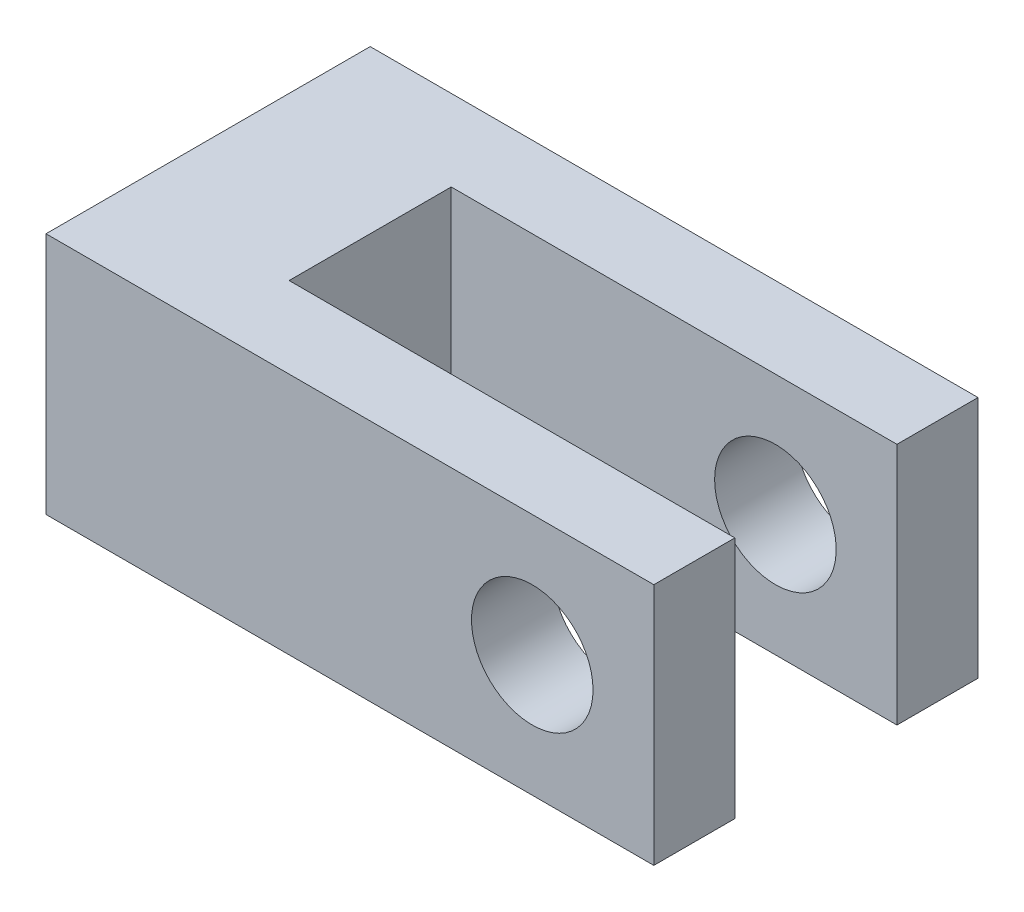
ISO-10303-21;
HEADER;
FILE_DESCRIPTION(('STEP AP214'),'2;1');
FILE_NAME('part.step','',(''),(''),'','','');
FILE_SCHEMA(('AUTOMOTIVE_DESIGN { 1 0 10303 214 1 1 1 1 }'));
ENDSEC;
DATA;
#1=APPLICATION_CONTEXT('core data for automotive mechanical design processes');
#2=APPLICATION_PROTOCOL_DEFINITION('international standard','automotive_design',2000,#1);
#3=PRODUCT_CONTEXT('',#1,'mechanical');
#4=PRODUCT('Part','Part','',(#3));
#5=PRODUCT_RELATED_PRODUCT_CATEGORY('part','',(#4));
#6=PRODUCT_DEFINITION_FORMATION('','',#4);
#7=PRODUCT_DEFINITION_CONTEXT('part definition',#1,'design');
#8=PRODUCT_DEFINITION('design','',#6,#7);
#9=PRODUCT_DEFINITION_SHAPE('','',#8);
#10=(LENGTH_UNIT() NAMED_UNIT(*) SI_UNIT(.MILLI.,.METRE.));
#11=(NAMED_UNIT(*) PLANE_ANGLE_UNIT() SI_UNIT($,.RADIAN.));
#12=(NAMED_UNIT(*) SI_UNIT($,.STERADIAN.) SOLID_ANGLE_UNIT());
#13=UNCERTAINTY_MEASURE_WITH_UNIT(LENGTH_MEASURE(1.E-05),#10,'distance_accuracy_value','');
#14=(GEOMETRIC_REPRESENTATION_CONTEXT(3) GLOBAL_UNCERTAINTY_ASSIGNED_CONTEXT((#13)) GLOBAL_UNIT_ASSIGNED_CONTEXT((#10,
#11,#12)) REPRESENTATION_CONTEXT('',''));
#15=CARTESIAN_POINT('',(0.,0.,0.));
#16=DIRECTION('',(0.,0.,1.));
#17=DIRECTION('',(1.,0.,0.));
#18=AXIS2_PLACEMENT_3D('',#15,#16,#17);
#19=CARTESIAN_POINT('',(9.525,9.525,25.4));
#20=DIRECTION('',(-1.,0.,0.));
#21=DIRECTION('',(0.,0.,1.));
#22=AXIS2_PLACEMENT_3D('',#19,#20,#21);
#23=PLANE('',#22);
#24=DIRECTION('',(0.,0.,-1.));
#25=VECTOR('',#24,1.);
#26=CARTESIAN_POINT('',(9.525,-9.525,25.4));
#27=LINE('',#26,#25);
#28=CARTESIAN_POINT('',(9.525,-9.525,25.4));
#29=VERTEX_POINT('',#28);
#30=CARTESIAN_POINT('',(9.525,-9.525,19.05));
#31=VERTEX_POINT('',#30);
#32=EDGE_CURVE('E45',#29,#31,#27,.T.);
#33=ORIENTED_EDGE('',*,*,#32,.T.);
#34=DIRECTION('',(0.,1.,0.));
#35=VECTOR('',#34,1.);
#36=CARTESIAN_POINT('',(9.525,-9.525,19.05));
#37=LINE('',#36,#35);
#38=CARTESIAN_POINT('',(9.525,9.525,19.05));
#39=VERTEX_POINT('',#38);
#40=EDGE_CURVE('E141',#31,#39,#37,.T.);
#41=ORIENTED_EDGE('',*,*,#40,.T.);
#42=DIRECTION('',(0.,0.,-1.));
#43=VECTOR('',#42,1.);
#44=CARTESIAN_POINT('',(9.525,9.525,25.4));
#45=LINE('',#44,#43);
#46=CARTESIAN_POINT('',(9.525,9.525,25.4));
#47=VERTEX_POINT('',#46);
#48=EDGE_CURVE('E131',#47,#39,#45,.T.);
#49=ORIENTED_EDGE('',*,*,#48,.F.);
#50=DIRECTION('',(0.,1.,0.));
#51=VECTOR('',#50,1.);
#52=CARTESIAN_POINT('',(9.525,9.525,25.4));
#53=LINE('',#52,#51);
#54=EDGE_CURVE('E158',#29,#47,#53,.T.);
#55=ORIENTED_EDGE('',*,*,#54,.F.);
#56=EDGE_LOOP('',(#33,#41,#49,#55));
#57=FACE_BOUND('',#56,.T.);
#58=ADVANCED_FACE('F36',(#57),#23,.F.);
#59=CARTESIAN_POINT('',(0.,0.,25.4));
#60=DIRECTION('',(0.,0.,-1.));
#61=DIRECTION('',(-1.,0.,0.));
#62=AXIS2_PLACEMENT_3D('',#59,#60,#61);
#63=CYLINDRICAL_SURFACE('',#62,4.7625);
#64=CARTESIAN_POINT('',(0.,0.,19.05));
#65=DIRECTION('',(0.,0.,1.));
#66=DIRECTION('',(1.,0.,0.));
#67=AXIS2_PLACEMENT_3D('',#64,#65,#66);
#68=CIRCLE('',#67,4.7625);
#69=CARTESIAN_POINT('',(4.7625,0.,19.05));
#70=VERTEX_POINT('',#69);
#71=EDGE_CURVE('E140',#70,#70,#68,.T.);
#72=ORIENTED_EDGE('',*,*,#71,.F.);
#73=EDGE_LOOP('',(#72));
#74=FACE_BOUND('',#73,.T.);
#75=CARTESIAN_POINT('',(0.,0.,25.4));
#76=DIRECTION('',(0.,0.,1.));
#77=DIRECTION('',(1.,0.,0.));
#78=AXIS2_PLACEMENT_3D('',#75,#76,#77);
#79=CIRCLE('',#78,4.7625);
#80=CARTESIAN_POINT('',(4.7625,0.,25.4));
#81=VERTEX_POINT('',#80);
#82=EDGE_CURVE('E147',#81,#81,#79,.T.);
#83=ORIENTED_EDGE('',*,*,#82,.T.);
#84=EDGE_LOOP('',(#83));
#85=FACE_BOUND('',#84,.T.);
#86=ADVANCED_FACE('F215',(#74,#85),#63,.F.);
#87=CARTESIAN_POINT('',(0.,0.,25.4));
#88=DIRECTION('',(0.,0.,1.));
#89=DIRECTION('',(1.,0.,0.));
#90=AXIS2_PLACEMENT_3D('',#87,#88,#89);
#91=PLANE('',#90);
#92=DIRECTION('',(0.,-1.,0.));
#93=VECTOR('',#92,1.);
#94=CARTESIAN_POINT('',(-38.1,9.525,25.4));
#95=LINE('',#94,#93);
#96=CARTESIAN_POINT('',(-38.1,9.525,25.4));
#97=VERTEX_POINT('',#96);
#98=CARTESIAN_POINT('',(-38.1,-9.525,25.4));
#99=VERTEX_POINT('',#98);
#100=EDGE_CURVE('E155',#97,#99,#95,.T.);
#101=ORIENTED_EDGE('',*,*,#100,.T.);
#102=DIRECTION('',(1.,0.,0.));
#103=VECTOR('',#102,1.);
#104=CARTESIAN_POINT('',(-38.1,-9.525,25.4));
#105=LINE('',#104,#103);
#106=EDGE_CURVE('E89',#99,#29,#105,.T.);
#107=ORIENTED_EDGE('',*,*,#106,.T.);
#108=ORIENTED_EDGE('',*,*,#54,.T.);
#109=DIRECTION('',(-1.,0.,0.));
#110=VECTOR('',#109,1.);
#111=CARTESIAN_POINT('',(-38.1,9.525,25.4));
#112=LINE('',#111,#110);
#113=EDGE_CURVE('E62',#47,#97,#112,.T.);
#114=ORIENTED_EDGE('',*,*,#113,.T.);
#115=EDGE_LOOP('',(#101,#107,#108,#114));
#116=FACE_BOUND('',#115,.T.);
#117=ORIENTED_EDGE('',*,*,#82,.F.);
#118=EDGE_LOOP('',(#117));
#119=FACE_BOUND('',#118,.T.);
#120=ADVANCED_FACE('F176',(#116,#119),#91,.T.);
#121=CARTESIAN_POINT('',(0.,0.,0.));
#122=DIRECTION('',(0.,0.,1.));
#123=DIRECTION('',(1.,0.,0.));
#124=AXIS2_PLACEMENT_3D('',#121,#122,#123);
#125=PLANE('',#124);
#126=DIRECTION('',(0.,-1.,0.));
#127=VECTOR('',#126,1.);
#128=CARTESIAN_POINT('',(-38.1,9.525,0.));
#129=LINE('',#128,#127);
#130=CARTESIAN_POINT('',(-38.1,9.525,0.));
#131=VERTEX_POINT('',#130);
#132=CARTESIAN_POINT('',(-38.1,-9.525,0.));
#133=VERTEX_POINT('',#132);
#134=EDGE_CURVE('E152',#131,#133,#129,.T.);
#135=ORIENTED_EDGE('',*,*,#134,.F.);
#136=DIRECTION('',(-1.,0.,0.));
#137=VECTOR('',#136,1.);
#138=CARTESIAN_POINT('',(-38.1,9.525,0.));
#139=LINE('',#138,#137);
#140=CARTESIAN_POINT('',(9.525,9.525,0.));
#141=VERTEX_POINT('',#140);
#142=EDGE_CURVE('E82',#141,#131,#139,.T.);
#143=ORIENTED_EDGE('',*,*,#142,.F.);
#144=DIRECTION('',(0.,1.,0.));
#145=VECTOR('',#144,1.);
#146=CARTESIAN_POINT('',(9.525,9.525,0.));
#147=LINE('',#146,#145);
#148=CARTESIAN_POINT('',(9.525,-9.525,0.));
#149=VERTEX_POINT('',#148);
#150=EDGE_CURVE('E165',#149,#141,#147,.T.);
#151=ORIENTED_EDGE('',*,*,#150,.F.);
#152=DIRECTION('',(1.,0.,0.));
#153=VECTOR('',#152,1.);
#154=CARTESIAN_POINT('',(-38.1,-9.525,0.));
#155=LINE('',#154,#153);
#156=EDGE_CURVE('E129',#133,#149,#155,.T.);
#157=ORIENTED_EDGE('',*,*,#156,.F.);
#158=EDGE_LOOP('',(#135,#143,#151,#157));
#159=FACE_BOUND('',#158,.T.);
#160=CARTESIAN_POINT('',(0.,0.,0.));
#161=DIRECTION('',(0.,0.,1.));
#162=DIRECTION('',(1.,0.,0.));
#163=AXIS2_PLACEMENT_3D('',#160,#161,#162);
#164=CIRCLE('',#163,4.7625);
#165=CARTESIAN_POINT('',(4.7625,0.,0.));
#166=VERTEX_POINT('',#165);
#167=EDGE_CURVE('E143',#166,#166,#164,.T.);
#168=ORIENTED_EDGE('',*,*,#167,.T.);
#169=EDGE_LOOP('',(#168));
#170=FACE_BOUND('',#169,.T.);
#171=ADVANCED_FACE('F174',(#159,#170),#125,.F.);
#172=CARTESIAN_POINT('',(-38.1,9.525,25.4));
#173=DIRECTION('',(1.,0.,0.));
#174=DIRECTION('',(0.,0.,-1.));
#175=AXIS2_PLACEMENT_3D('',#172,#173,#174);
#176=PLANE('',#175);
#177=CARTESIAN_POINT('',(-38.1,0.,12.7));
#178=DIRECTION('',(-1.,0.,0.));
#179=DIRECTION('',(0.,0.,1.));
#180=AXIS2_PLACEMENT_3D('',#177,#178,#179);
#181=CIRCLE('',#180,0.254000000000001);
#182=CARTESIAN_POINT('',(-38.1,0.,12.954));
#183=VERTEX_POINT('',#182);
#184=EDGE_CURVE('E198',#183,#183,#181,.T.);
#185=ORIENTED_EDGE('',*,*,#184,.F.);
#186=EDGE_LOOP('',(#185));
#187=FACE_BOUND('',#186,.T.);
#188=ORIENTED_EDGE('',*,*,#134,.T.);
#189=DIRECTION('',(0.,0.,-1.));
#190=VECTOR('',#189,1.);
#191=CARTESIAN_POINT('',(-38.1,-9.525,25.4));
#192=LINE('',#191,#190);
#193=EDGE_CURVE('E11',#99,#133,#192,.T.);
#194=ORIENTED_EDGE('',*,*,#193,.F.);
#195=ORIENTED_EDGE('',*,*,#100,.F.);
#196=DIRECTION('',(0.,0.,-1.));
#197=VECTOR('',#196,1.);
#198=CARTESIAN_POINT('',(-38.1,9.525,25.4));
#199=LINE('',#198,#197);
#200=EDGE_CURVE('E161',#97,#131,#199,.T.);
#201=ORIENTED_EDGE('',*,*,#200,.T.);
#202=EDGE_LOOP('',(#188,#194,#195,#201));
#203=FACE_BOUND('',#202,.T.);
#204=ADVANCED_FACE('F38',(#187,#203),#176,.F.);
#205=CARTESIAN_POINT('',(-38.1,-9.525,25.4));
#206=DIRECTION('',(0.,1.,0.));
#207=DIRECTION('',(0.,0.,1.));
#208=AXIS2_PLACEMENT_3D('',#205,#206,#207);
#209=PLANE('',#208);
#210=DIRECTION('',(0.,0.,1.));
#211=VECTOR('',#210,1.);
#212=CARTESIAN_POINT('',(-25.4,-9.525,6.35));
#213=LINE('',#212,#211);
#214=CARTESIAN_POINT('',(-25.4,-9.525,6.35));
#215=VERTEX_POINT('',#214);
#216=CARTESIAN_POINT('',(-25.4,-9.525,19.05));
#217=VERTEX_POINT('',#216);
#218=EDGE_CURVE('E116',#215,#217,#213,.T.);
#219=ORIENTED_EDGE('',*,*,#218,.T.);
#220=DIRECTION('',(1.,0.,0.));
#221=VECTOR('',#220,1.);
#222=CARTESIAN_POINT('',(9.525,-9.525,19.05));
#223=LINE('',#222,#221);
#224=EDGE_CURVE('E126',#217,#31,#223,.T.);
#225=ORIENTED_EDGE('',*,*,#224,.T.);
#226=ORIENTED_EDGE('',*,*,#32,.F.);
#227=ORIENTED_EDGE('',*,*,#106,.F.);
#228=ORIENTED_EDGE('',*,*,#193,.T.);
#229=ORIENTED_EDGE('',*,*,#156,.T.);
#230=CARTESIAN_POINT('',(9.525,-9.525,6.35));
#231=VERTEX_POINT('',#230);
#232=EDGE_CURVE('E123',#231,#149,#27,.T.);
#233=ORIENTED_EDGE('',*,*,#232,.F.);
#234=DIRECTION('',(-1.,0.,0.));
#235=VECTOR('',#234,1.);
#236=CARTESIAN_POINT('',(9.525,-9.525,6.35));
#237=LINE('',#236,#235);
#238=EDGE_CURVE('E110',#231,#215,#237,.T.);
#239=ORIENTED_EDGE('',*,*,#238,.T.);
#240=EDGE_LOOP('',(#219,#225,#226,#227,#228,#229,#233,#239));
#241=FACE_BOUND('',#240,.T.);
#242=ADVANCED_FACE('F128',(#241),#209,.F.);
#243=CARTESIAN_POINT('',(9.525,9.525,6.35));
#244=VERTEX_POINT('',#243);
#245=EDGE_CURVE('E125',#244,#141,#45,.T.);
#246=ORIENTED_EDGE('',*,*,#245,.F.);
#247=DIRECTION('',(0.,1.,0.));
#248=VECTOR('',#247,1.);
#249=CARTESIAN_POINT('',(9.525,-9.525,6.35));
#250=LINE('',#249,#248);
#251=EDGE_CURVE('E53',#231,#244,#250,.T.);
#252=ORIENTED_EDGE('',*,*,#251,.F.);
#253=ORIENTED_EDGE('',*,*,#232,.T.);
#254=ORIENTED_EDGE('',*,*,#150,.T.);
#255=EDGE_LOOP('',(#246,#252,#253,#254));
#256=FACE_BOUND('',#255,.T.);
#257=ADVANCED_FACE('F121',(#256),#23,.F.);
#258=CARTESIAN_POINT('',(-38.1,9.525,25.4));
#259=DIRECTION('',(0.,-1.,0.));
#260=DIRECTION('',(0.,0.,-1.));
#261=AXIS2_PLACEMENT_3D('',#258,#259,#260);
#262=PLANE('',#261);
#263=ORIENTED_EDGE('',*,*,#48,.T.);
#264=DIRECTION('',(1.,0.,0.));
#265=VECTOR('',#264,1.);
#266=CARTESIAN_POINT('',(9.525,9.525,19.05));
#267=LINE('',#266,#265);
#268=CARTESIAN_POINT('',(-25.4,9.525,19.05));
#269=VERTEX_POINT('',#268);
#270=EDGE_CURVE('E117',#269,#39,#267,.T.);
#271=ORIENTED_EDGE('',*,*,#270,.F.);
#272=DIRECTION('',(0.,0.,1.));
#273=VECTOR('',#272,1.);
#274=CARTESIAN_POINT('',(-25.4,9.525,6.35));
#275=LINE('',#274,#273);
#276=CARTESIAN_POINT('',(-25.4,9.525,6.35));
#277=VERTEX_POINT('',#276);
#278=EDGE_CURVE('E186',#277,#269,#275,.T.);
#279=ORIENTED_EDGE('',*,*,#278,.F.);
#280=DIRECTION('',(-1.,0.,0.));
#281=VECTOR('',#280,1.);
#282=CARTESIAN_POINT('',(9.525,9.525,6.35));
#283=LINE('',#282,#281);
#284=EDGE_CURVE('E172',#244,#277,#283,.T.);
#285=ORIENTED_EDGE('',*,*,#284,.F.);
#286=ORIENTED_EDGE('',*,*,#245,.T.);
#287=ORIENTED_EDGE('',*,*,#142,.T.);
#288=ORIENTED_EDGE('',*,*,#200,.F.);
#289=ORIENTED_EDGE('',*,*,#113,.F.);
#290=EDGE_LOOP('',(#263,#271,#279,#285,#286,#287,#288,#289));
#291=FACE_BOUND('',#290,.T.);
#292=ADVANCED_FACE('F170',(#291),#262,.F.);
#293=CARTESIAN_POINT('',(0.,0.,6.35));
#294=DIRECTION('',(0.,0.,-1.));
#295=DIRECTION('',(-1.,0.,0.));
#296=AXIS2_PLACEMENT_3D('',#293,#294,#295);
#297=CIRCLE('',#296,4.7625);
#298=CARTESIAN_POINT('',(-4.7625,0.,6.35));
#299=VERTEX_POINT('',#298);
#300=EDGE_CURVE('E138',#299,#299,#297,.T.);
#301=ORIENTED_EDGE('',*,*,#300,.F.);
#302=EDGE_LOOP('',(#301));
#303=FACE_BOUND('',#302,.T.);
#304=ORIENTED_EDGE('',*,*,#167,.F.);
#305=EDGE_LOOP('',(#304));
#306=FACE_BOUND('',#305,.T.);
#307=ADVANCED_FACE('F222',(#303,#306),#63,.F.);
#308=CARTESIAN_POINT('',(9.525,-9.525,19.05));
#309=DIRECTION('',(0.,0.,1.));
#310=DIRECTION('',(1.,0.,0.));
#311=AXIS2_PLACEMENT_3D('',#308,#309,#310);
#312=PLANE('',#311);
#313=ORIENTED_EDGE('',*,*,#71,.T.);
#314=EDGE_LOOP('',(#313));
#315=FACE_BOUND('',#314,.T.);
#316=ORIENTED_EDGE('',*,*,#270,.T.);
#317=ORIENTED_EDGE('',*,*,#40,.F.);
#318=ORIENTED_EDGE('',*,*,#224,.F.);
#319=DIRECTION('',(0.,1.,0.));
#320=VECTOR('',#319,1.);
#321=CARTESIAN_POINT('',(-25.4,-9.525,19.05));
#322=LINE('',#321,#320);
#323=EDGE_CURVE('E193',#217,#269,#322,.T.);
#324=ORIENTED_EDGE('',*,*,#323,.T.);
#325=EDGE_LOOP('',(#316,#317,#318,#324));
#326=FACE_BOUND('',#325,.T.);
#327=ADVANCED_FACE('F231',(#315,#326),#312,.F.);
#328=CARTESIAN_POINT('',(-25.4,-9.525,6.35));
#329=DIRECTION('',(-1.,0.,0.));
#330=DIRECTION('',(0.,0.,1.));
#331=AXIS2_PLACEMENT_3D('',#328,#329,#330);
#332=PLANE('',#331);
#333=CARTESIAN_POINT('',(-25.4,0.,12.7));
#334=DIRECTION('',(-1.,0.,0.));
#335=DIRECTION('',(0.,0.,1.));
#336=AXIS2_PLACEMENT_3D('',#333,#334,#335);
#337=CIRCLE('',#336,0.254000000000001);
#338=CARTESIAN_POINT('',(-25.4,0.,12.954));
#339=VERTEX_POINT('',#338);
#340=EDGE_CURVE('E40',#339,#339,#337,.T.);
#341=ORIENTED_EDGE('',*,*,#340,.T.);
#342=EDGE_LOOP('',(#341));
#343=FACE_BOUND('',#342,.T.);
#344=ORIENTED_EDGE('',*,*,#278,.T.);
#345=ORIENTED_EDGE('',*,*,#323,.F.);
#346=ORIENTED_EDGE('',*,*,#218,.F.);
#347=DIRECTION('',(0.,1.,0.));
#348=VECTOR('',#347,1.);
#349=CARTESIAN_POINT('',(-25.4,-9.525,6.35));
#350=LINE('',#349,#348);
#351=EDGE_CURVE('E112',#215,#277,#350,.T.);
#352=ORIENTED_EDGE('',*,*,#351,.T.);
#353=EDGE_LOOP('',(#344,#345,#346,#352));
#354=FACE_BOUND('',#353,.T.);
#355=ADVANCED_FACE('F196',(#343,#354),#332,.F.);
#356=CARTESIAN_POINT('',(9.525,-9.525,6.35));
#357=DIRECTION('',(0.,0.,-1.));
#358=DIRECTION('',(-1.,0.,0.));
#359=AXIS2_PLACEMENT_3D('',#356,#357,#358);
#360=PLANE('',#359);
#361=ORIENTED_EDGE('',*,*,#300,.T.);
#362=EDGE_LOOP('',(#361));
#363=FACE_BOUND('',#362,.T.);
#364=ORIENTED_EDGE('',*,*,#284,.T.);
#365=ORIENTED_EDGE('',*,*,#351,.F.);
#366=ORIENTED_EDGE('',*,*,#238,.F.);
#367=ORIENTED_EDGE('',*,*,#251,.T.);
#368=EDGE_LOOP('',(#364,#365,#366,#367));
#369=FACE_BOUND('',#368,.T.);
#370=ADVANCED_FACE('F111',(#363,#369),#360,.F.);
#371=CARTESIAN_POINT('',(9.525,0.,12.7));
#372=DIRECTION('',(-1.,0.,0.));
#373=DIRECTION('',(0.,0.,1.));
#374=AXIS2_PLACEMENT_3D('',#371,#372,#373);
#375=CYLINDRICAL_SURFACE('',#374,0.254000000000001);
#376=ORIENTED_EDGE('',*,*,#184,.T.);
#377=EDGE_LOOP('',(#376));
#378=FACE_BOUND('',#377,.T.);
#379=ORIENTED_EDGE('',*,*,#340,.F.);
#380=EDGE_LOOP('',(#379));
#381=FACE_BOUND('',#380,.T.);
#382=ADVANCED_FACE('F205',(#378,#381),#375,.F.);
#383=CLOSED_SHELL('',(#58,#86,#120,#171,#204,#242,#257,#292,#307,#327,#355,#370,#382));
#384=MANIFOLD_SOLID_BREP('B2',#383);
#385=ADVANCED_BREP_SHAPE_REPRESENTATION('',(#18,#384),#14);
#386=SHAPE_DEFINITION_REPRESENTATION(#9,#385);
ENDSEC;
END-ISO-10303-21;
